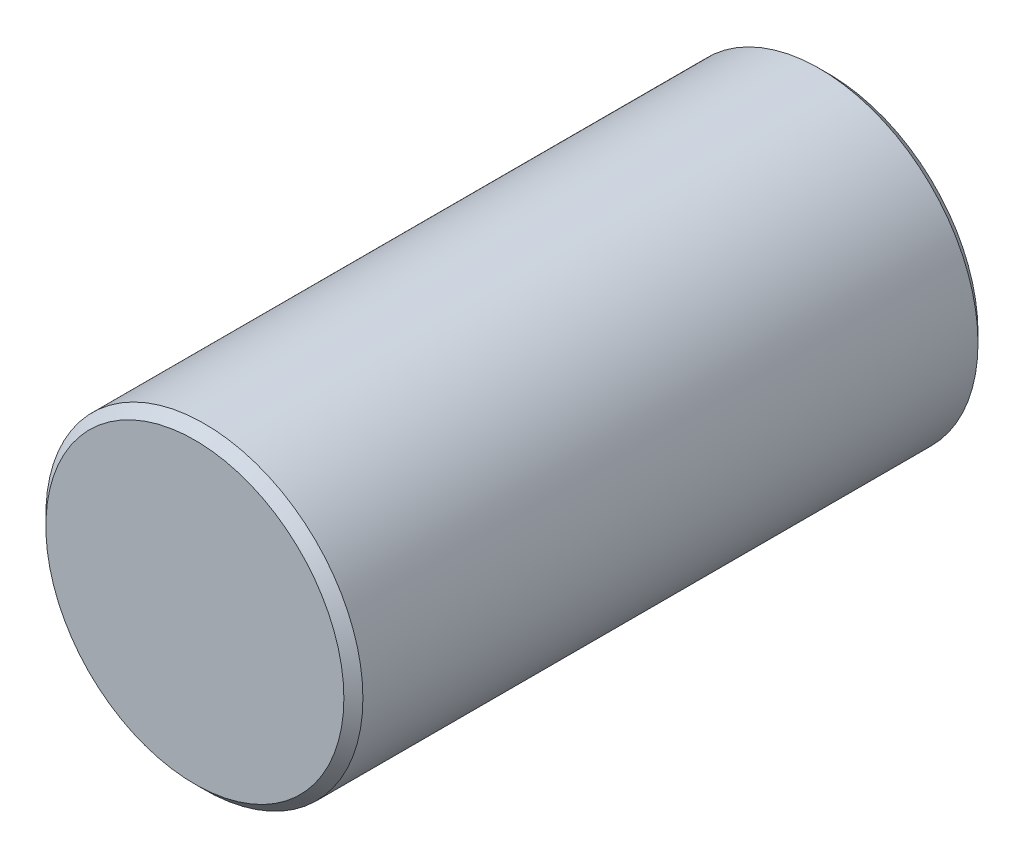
ISO-10303-21;
HEADER;
FILE_DESCRIPTION(('STEP AP214'),'2;1');
FILE_NAME('part.step','',(''),(''),'','','');
FILE_SCHEMA(('AUTOMOTIVE_DESIGN { 1 0 10303 214 1 1 1 1 }'));
ENDSEC;
DATA;
#1=APPLICATION_CONTEXT('core data for automotive mechanical design processes');
#2=APPLICATION_PROTOCOL_DEFINITION('international standard','automotive_design',2000,#1);
#3=PRODUCT_CONTEXT('',#1,'mechanical');
#4=PRODUCT('Part','Part','',(#3));
#5=PRODUCT_RELATED_PRODUCT_CATEGORY('part','',(#4));
#6=PRODUCT_DEFINITION_FORMATION('','',#4);
#7=PRODUCT_DEFINITION_CONTEXT('part definition',#1,'design');
#8=PRODUCT_DEFINITION('design','',#6,#7);
#9=PRODUCT_DEFINITION_SHAPE('','',#8);
#10=(LENGTH_UNIT() NAMED_UNIT(*) SI_UNIT(.MILLI.,.METRE.));
#11=(NAMED_UNIT(*) PLANE_ANGLE_UNIT() SI_UNIT($,.RADIAN.));
#12=(NAMED_UNIT(*) SI_UNIT($,.STERADIAN.) SOLID_ANGLE_UNIT());
#13=UNCERTAINTY_MEASURE_WITH_UNIT(LENGTH_MEASURE(1.E-05),#10,'distance_accuracy_value','');
#14=(GEOMETRIC_REPRESENTATION_CONTEXT(3) GLOBAL_UNCERTAINTY_ASSIGNED_CONTEXT((#13)) GLOBAL_UNIT_ASSIGNED_CONTEXT((#10,
#11,#12)) REPRESENTATION_CONTEXT('',''));
#15=CARTESIAN_POINT('',(0.,0.,0.));
#16=DIRECTION('',(0.,0.,1.));
#17=DIRECTION('',(1.,0.,0.));
#18=AXIS2_PLACEMENT_3D('',#15,#16,#17);
#19=CARTESIAN_POINT('',(0.,0.,25.4));
#20=DIRECTION('',(0.,0.,-1.));
#21=DIRECTION('',(-1.,0.,0.));
#22=AXIS2_PLACEMENT_3D('',#19,#20,#21);
#23=CYLINDRICAL_SURFACE('',#22,12.7);
#24=CARTESIAN_POINT('',(0.,0.,-24.638));
#25=DIRECTION('',(0.,0.,1.));
#26=DIRECTION('',(1.,0.,0.));
#27=AXIS2_PLACEMENT_3D('',#24,#25,#26);
#28=CIRCLE('',#27,12.7);
#29=CARTESIAN_POINT('',(12.7,0.,-24.638));
#30=VERTEX_POINT('',#29);
#31=EDGE_CURVE('E38',#30,#30,#28,.T.);
#32=ORIENTED_EDGE('',*,*,#31,.T.);
#33=EDGE_LOOP('',(#32));
#34=FACE_BOUND('',#33,.T.);
#35=CARTESIAN_POINT('',(0.,0.,24.638));
#36=DIRECTION('',(0.,0.,1.));
#37=DIRECTION('',(1.,0.,0.));
#38=AXIS2_PLACEMENT_3D('',#35,#36,#37);
#39=CIRCLE('',#38,12.7);
#40=CARTESIAN_POINT('',(12.7,0.,24.638));
#41=VERTEX_POINT('',#40);
#42=EDGE_CURVE('E42',#41,#41,#39,.F.);
#43=ORIENTED_EDGE('',*,*,#42,.T.);
#44=EDGE_LOOP('',(#43));
#45=FACE_BOUND('',#44,.T.);
#46=ADVANCED_FACE('F31',(#34,#45),#23,.T.);
#47=CARTESIAN_POINT('',(0.,0.,25.4));
#48=DIRECTION('',(0.,0.,1.));
#49=DIRECTION('',(1.,0.,0.));
#50=AXIS2_PLACEMENT_3D('',#47,#48,#49);
#51=PLANE('',#50);
#52=CARTESIAN_POINT('',(0.,0.,25.4));
#53=DIRECTION('',(0.,0.,1.));
#54=DIRECTION('',(1.,0.,0.));
#55=AXIS2_PLACEMENT_3D('',#52,#53,#54);
#56=CIRCLE('',#55,11.938);
#57=CARTESIAN_POINT('',(11.938,0.,25.4));
#58=VERTEX_POINT('',#57);
#59=EDGE_CURVE('E46',#58,#58,#56,.T.);
#60=ORIENTED_EDGE('',*,*,#59,.T.);
#61=EDGE_LOOP('',(#60));
#62=FACE_BOUND('',#61,.T.);
#63=ADVANCED_FACE('F52',(#62),#51,.T.);
#64=CARTESIAN_POINT('',(0.,0.,-25.4));
#65=DIRECTION('',(0.,0.,1.));
#66=DIRECTION('',(1.,0.,0.));
#67=AXIS2_PLACEMENT_3D('',#64,#65,#66);
#68=PLANE('',#67);
#69=CARTESIAN_POINT('',(0.,0.,-25.4));
#70=DIRECTION('',(0.,0.,1.));
#71=DIRECTION('',(1.,0.,0.));
#72=AXIS2_PLACEMENT_3D('',#69,#70,#71);
#73=CIRCLE('',#72,11.938);
#74=CARTESIAN_POINT('',(11.938,0.,-25.4));
#75=VERTEX_POINT('',#74);
#76=EDGE_CURVE('E10',#75,#75,#73,.F.);
#77=ORIENTED_EDGE('',*,*,#76,.T.);
#78=EDGE_LOOP('',(#77));
#79=FACE_BOUND('',#78,.T.);
#80=ADVANCED_FACE('F56',(#79),#68,.F.);
#81=CARTESIAN_POINT('',(0.,0.,25.4));
#82=DIRECTION('',(0.,0.,-1.));
#83=DIRECTION('',(-1.,0.,0.));
#84=AXIS2_PLACEMENT_3D('',#81,#82,#83);
#85=CONICAL_SURFACE('',#84,11.938,0.785398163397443);
#86=ORIENTED_EDGE('',*,*,#42,.F.);
#87=EDGE_LOOP('',(#86));
#88=FACE_BOUND('',#87,.T.);
#89=ORIENTED_EDGE('',*,*,#59,.F.);
#90=EDGE_LOOP('',(#89));
#91=FACE_BOUND('',#90,.T.);
#92=ADVANCED_FACE('F54',(#88,#91),#85,.T.);
#93=CARTESIAN_POINT('',(0.,0.,-24.638));
#94=DIRECTION('',(0.,0.,1.));
#95=DIRECTION('',(1.,0.,0.));
#96=AXIS2_PLACEMENT_3D('',#93,#94,#95);
#97=CONICAL_SURFACE('',#96,12.7,0.785398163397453);
#98=ORIENTED_EDGE('',*,*,#76,.F.);
#99=EDGE_LOOP('',(#98));
#100=FACE_BOUND('',#99,.T.);
#101=ORIENTED_EDGE('',*,*,#31,.F.);
#102=EDGE_LOOP('',(#101));
#103=FACE_BOUND('',#102,.T.);
#104=ADVANCED_FACE('F33',(#100,#103),#97,.T.);
#105=CLOSED_SHELL('',(#46,#63,#80,#92,#104));
#106=MANIFOLD_SOLID_BREP('B2',#105);
#107=ADVANCED_BREP_SHAPE_REPRESENTATION('',(#18,#106),#14);
#108=SHAPE_DEFINITION_REPRESENTATION(#9,#107);
ENDSEC;
END-ISO-10303-21;
